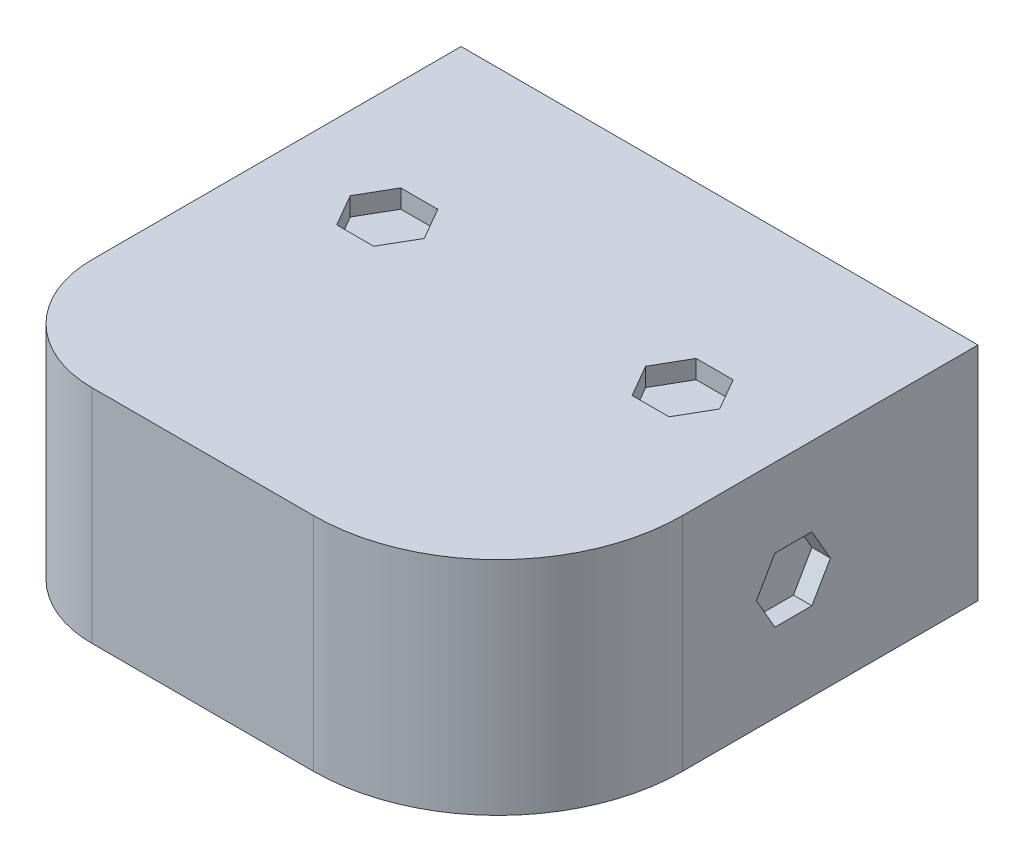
from build123d import *

# Parameters (mm, degrees)
BOSS_EXTRUDE1_DEPTH = 38.1
CUT_EXTRUDE1_DEPTH  = 3.175
CUT_EXTRUDE2_DEPTH  = 3.175
CUT_EXTRUDE3_DEPTH  = 3.175


with BuildPart() as part:
    # Sketch1 → Boss-Extrude1 (new body)
    with BuildSketch(Plane(origin=(0, 0, 0), x_dir=(1, 0, 0), z_dir=(0, 1, 0))):
        with BuildLine():
            Line((19.05, 0), (57.15, 0))
            ThreePointArc((57.15, 0), (79.600640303, 9.299359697), (88.9, 31.75))
            Line((88.9, 31.75), (88.9, 82.55))
            Line((88.9, 82.55), (0, 82.55))
            Line((0, 82.55), (0, 19.05))
            ThreePointArc((0, 19.05), (5.579615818, 5.579615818), (19.05, 0))
        make_face()
    extrude(amount=BOSS_EXTRUDE1_DEPTH)

    # Sketch2 → Cut-Extrude1 (cut)
    with BuildSketch(Plane(origin=(0, 0, -82.55), x_dir=(-1, 0, 0), z_dir=(0, 0, -1))):
        Polygon((-25.414478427, 18.168889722), (-22.232239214, 12.657089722), (-15.867760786, 12.657089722), (-12.685521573, 18.168889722), (-15.867760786, 23.680689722), (-22.232239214, 23.680689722), align=None)
        Polygon((-73.032239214, 11.597323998), (-66.667760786, 11.597323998), (-63.485521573, 17.109123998), (-66.667760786, 22.620923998), (-73.032239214, 22.620923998), (-76.214478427, 17.109123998), align=None)
    extrude(amount=-CUT_EXTRUDE1_DEPTH, mode=Mode.SUBTRACT)

    # Sketch3 → Cut-Extrude2 (cut)
    with BuildSketch(Plane(origin=(0, 38.1, 0), x_dir=(1, 0, 0), z_dir=(0, 1, 0))):
        Polygon((63.485521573, 50.8), (66.667760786, 45.2882), (73.032239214, 45.2882), (76.214478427, 50.8), (73.032239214, 56.3118), (66.667760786, 56.3118), align=None)
        Polygon((15.867760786, 45.2882), (22.232239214, 45.2882), (25.414478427, 50.8), (22.232239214, 56.3118), (15.867760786, 56.3118), (12.685521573, 50.8), align=None)
    extrude(amount=-CUT_EXTRUDE2_DEPTH, mode=Mode.SUBTRACT)

    # Sketch4 → Cut-Extrude3 (cut)
    with BuildSketch(Plane(origin=(88.9, 0, 0), x_dir=(0, 0, -1), z_dir=(1, 0, 0))):
        Polygon((47.617760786, 13.5382), (53.982239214, 13.5382), (57.164478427, 19.05), (53.982239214, 24.5618), (47.617760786, 24.5618), (44.435521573, 19.05), align=None)
    extrude(amount=-CUT_EXTRUDE3_DEPTH, mode=Mode.SUBTRACT)


solid = part.part
